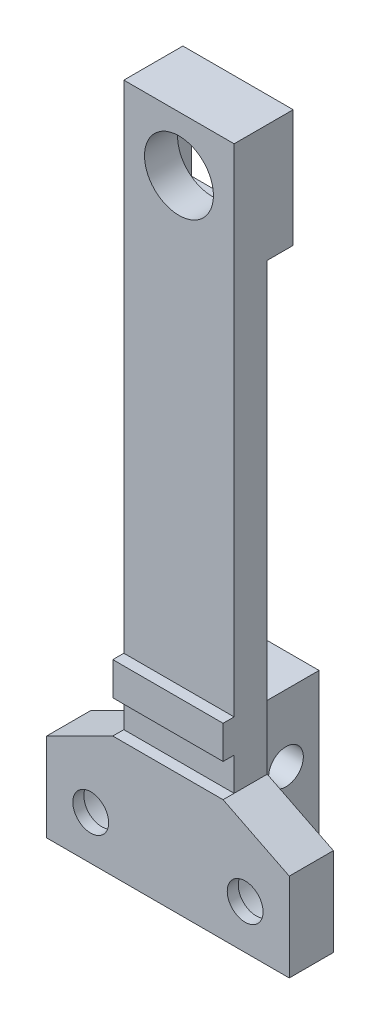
from build123d import *

# Parameters (mm, degrees)
CROQUIS1_W              = 10
CROQUIS1_H              = 60
SALIENTE_EXTRUIR1_DEPTH = 3
CROQUIS2_W              = 10
CROQUIS2_H              = 9
CROQUIS2_H_2            = 3
SALIENTE_EXTRUIR2_DEPTH = 1
CROQUIS3_R              = 3.125
CORTAR_EXTRUIR1_DEPTH   = 3
SALIENTE_EXTRUIR3_DEPTH = 4
CROQUIS10_W             = 22
CROQUIS10_H             = 2
SALIENTE_EXTRUIR6_DEPTH = 4
CROQUIS5_R              = 3
CORTAR_EXTRUIR2_DEPTH   = 3
CROQUIS7_R              = 1.625
CORTAR_EXTRUIR3_DEPTH   = 4
SALIENTE_EXTRUIR4_DEPTH = 15
CROQUIS9_W              = 10
CROQUIS9_H              = 10.628903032
SALIENTE_EXTRUIR5_DEPTH = 1
SKETCH1_W               = 7.401755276
SKETCH1_H               = 14
SKETCH1_W_2             = 3.2
SKETCH1_H_2             = 6.2
BOSS_EXTRUDE1_DEPTH     = 6
SKETCH2_R               = 1.575
CUT_EXTRUDE1_DEPTH      = 12
SKETCH3_W               = 13.645289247
SKETCH3_H               = 12.815137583
CUT_EXTRUDE2_DEPTH      = 10


with BuildPart() as part:
    # Croquis1 → Saliente-Extruir1 (new body)
    with BuildSketch(Plane.XY):
        Rectangle(CROQUIS1_W, CROQUIS1_H)
    extrude(amount=SALIENTE_EXTRUIR1_DEPTH)

    # Croquis2 → Saliente-Extruir2 (add)
    with BuildSketch(Plane.XY.offset(3)):
        with Locations((0, -25.5)):
            Rectangle(CROQUIS2_W, CROQUIS2_H)
        with Locations((0, -16.5)):
            Rectangle(CROQUIS2_W, CROQUIS2_H_2)
    extrude(amount=SALIENTE_EXTRUIR2_DEPTH)

    # Croquis3 → Cortar-Extruir1 (cut)
    with BuildSketch(Plane.XY.offset(3)):
        with Locations((0, 25)):
            Circle(CROQUIS3_R)
    extrude(amount=-CORTAR_EXTRUIR1_DEPTH, mode=Mode.SUBTRACT)

    # Croquis4 → Saliente-Extruir3 (add)
    with BuildSketch(Plane(origin=(0, 0, 0), x_dir=(-1, 0, 0), z_dir=(0, 0, -1))):
        Polygon((-5, -30), (-11, -30), (-11, -24), (-5, -21), align=None)
        Polygon((5, -21), (5, -30), (11, -30), (11, -24), align=None)
    extrude(amount=-SALIENTE_EXTRUIR3_DEPTH)

    # Croquis10 → Saliente-Extruir6 (add)
    with BuildSketch(Plane(origin=(0, 0, 0), x_dir=(-1, 0, 0), z_dir=(0, 0, -1))):
        with Locations((0, -31)):
            Rectangle(CROQUIS10_W, CROQUIS10_H)
    extrude(amount=-SALIENTE_EXTRUIR6_DEPTH)

    # Croquis5 → Cortar-Extruir2 (cut)
    with BuildSketch(Plane(origin=(0, 0, 0), x_dir=(-1, 0, 0), z_dir=(0, 0, -1))):
        with Locations((-7, -28)):
            Circle(CROQUIS5_R)
        with Locations((7, -28)):
            Circle(CROQUIS5_R)
    extrude(amount=-CORTAR_EXTRUIR2_DEPTH, mode=Mode.SUBTRACT)

    # Croquis7 → Cortar-Extruir3 (cut)
    with BuildSketch(Plane(origin=(0, 0, 3), x_dir=(-1, 0, 0), z_dir=(0, 0, -1))):
        with Locations((-7, -28)):
            Circle(CROQUIS7_R)
        with Locations((7, -28)):
            Circle(CROQUIS7_R)
    extrude(amount=-CORTAR_EXTRUIR3_DEPTH, mode=Mode.SUBTRACT)

    # Croquis8 → Saliente-Extruir4 (add)
    with BuildSketch(Plane(origin=(0, 0, 0), x_dir=(-1, 0, 0), z_dir=(0, 0, -1))):
        Polygon((-5, 19.343029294), (-4.120724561, 19.343029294), (-1, 19.343029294), (-1, 20.143029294), (-4.2, 20.143029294), (-4.2, 29.2), (4.2, 29.2), (4.2, 20.171096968), (1, 20.171096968), (1, 19.371096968), (4.24632371, 19.371096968), (5, 19.371096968), (5, 30), (-5, 30), align=None)
    extrude(amount=SALIENTE_EXTRUIR4_DEPTH)

    # Croquis9 → Saliente-Extruir5 (add)
    with BuildSketch(Plane(origin=(0, 0, -15), x_dir=(-1, 0, 0), z_dir=(0, 0, -1))):
        with Locations((0, 24.685548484)):
            Rectangle(CROQUIS9_W, CROQUIS9_H)
    extrude(amount=SALIENTE_EXTRUIR5_DEPTH)

    # Sketch1 → Boss-Extrude1 (add)
    with BuildSketch(Plane(origin=(0, 0, 0), x_dir=(-1, 0, 0), z_dir=(0, 0, -1))):
        with Locations((0, -23.5)):
            Rectangle(SKETCH1_W, SKETCH1_H)
        with Locations((1.100877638, -23.5)):
            Rectangle(SKETCH1_W_2, SKETCH1_H_2, mode=Mode.SUBTRACT)
    extrude(amount=BOSS_EXTRUDE1_DEPTH)

    # Sketch2 → Cut-Extrude1 (cut)
    with BuildSketch(Plane(origin=(3.700877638, 0, 0), x_dir=(0, 0, -1), z_dir=(1, 0, 0))):
        with Locations((3, -22.559998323)):
            Circle(SKETCH2_R)
    extrude(amount=-CUT_EXTRUDE1_DEPTH, mode=Mode.SUBTRACT)

    # Sketch3 → Cut-Extrude2 (cut)
    with BuildSketch(Plane.ZY.offset(5)):
        with Locations((-9.177355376, 23.592431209)):
            Rectangle(SKETCH3_W, SKETCH3_H)
    extrude(amount=-CUT_EXTRUDE2_DEPTH, mode=Mode.SUBTRACT)


solid = part.part
